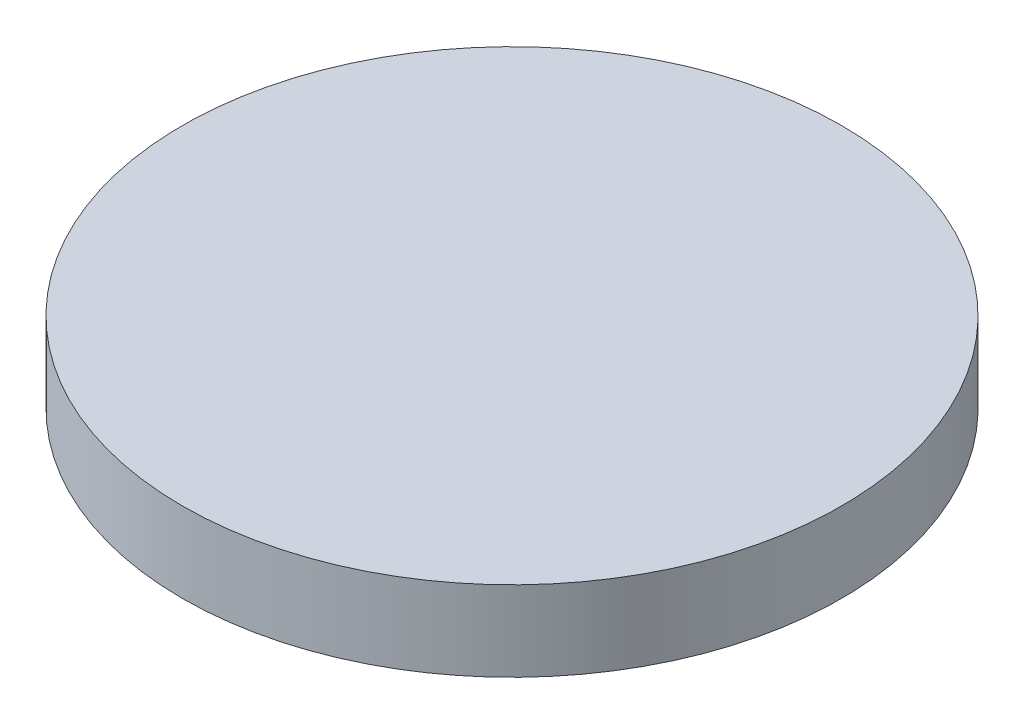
from build123d import *

# Parameters (mm, degrees)
SKETCH1_R           = 57.4675
BOSS_EXTRUDE1_DEPTH = 13.97


with BuildPart() as part:
    # Sketch1 → Boss-Extrude1 (new body)
    with BuildSketch(Plane(origin=(0, 0, 0), x_dir=(1, 0, 0), z_dir=(0, 1, 0))):
        with Locations(Location((0, 0, 0), (0, 0, 270))):
            Circle(SKETCH1_R)
    extrude(amount=BOSS_EXTRUDE1_DEPTH)


solid = part.part
